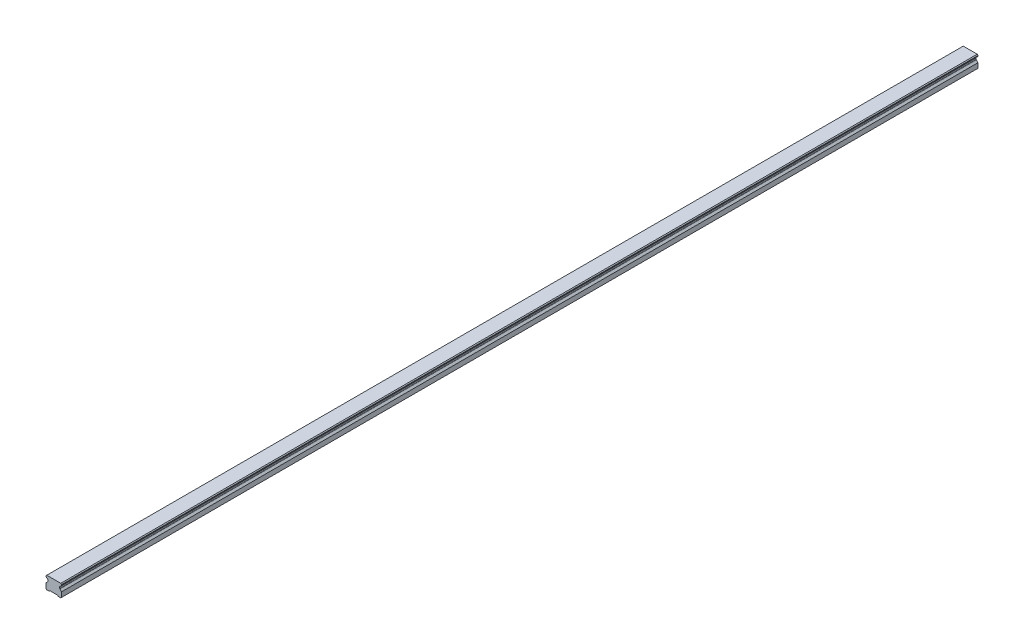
from build123d import *

# Parameters (mm, degrees)
SKETCH1_W           = 20
SKETCH1_H           = 16.3
BOSS_EXTRUDE1_DEPTH = 590
CUT_EXTRUDE1_DEPTH  = 1181.154943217
CHAMFER1_SIZE       = 1
FILLET1_R           = 1
CUT_EXTRUDE2_DEPTH  = 1181.154943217
SKETCH5_R           = 3
SKETCH5_R_2         = 2.5
CUT_EXTRUDE5_DEPTH  = 10
SKETCH5_2_R         = 2.5
CUT_EXTRUDE6_DEPTH  = 13
LPATTERN2_COUNT     = 20
LPATTERN2_PITCH     = 60


with BuildPart() as part:
    # Sketch1 → Boss-Extrude1 (new, symmetric)
    with BuildSketch(Plane.XY):
        with Locations((0, 8.15)):
            Rectangle(SKETCH1_W, SKETCH1_H)
    extrude(amount=BOSS_EXTRUDE1_DEPTH, both=True)

    # Sketch2 → Cut-Extrude1 (cut, through all)
    with BuildSketch(Plane.XY.offset(590)):
        Polygon((-10, 14.3), (-10, 7.3), (-7.666666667, 9.633333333), (-7.666666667, 11.966666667), align=None)
        Polygon((7.666666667, 11.966666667), (10, 14.3), (10, 7.3), (7.666666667, 9.633333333), align=None)
    extrude(amount=-CUT_EXTRUDE1_DEPTH, mode=Mode.SUBTRACT)

    # Chamfer1
    chamfer1_edges = [part.edges().sort_by_distance(p)[0] for p in [
        (-10, 16.3, 0),
        (10, 16.3, 0),
        (10, 0, 0),
        (-10, 0, 0),
    ]]
    chamfer(chamfer1_edges, length=CHAMFER1_SIZE)

    # Fillet1
    fillet1_edges = [part.edges().sort_by_distance(p)[0] for p in [
        (-7.666666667, 11.966666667, 0),
        (-7.666666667, 9.633333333, 0),
        (7.666666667, 9.633333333, 0),
        (7.666666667, 11.966666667, 0),
    ]]
    fillet(fillet1_edges, radius=FILLET1_R)

    # Sketch3 → Cut-Extrude2 (cut, through all)
    with BuildSketch(Plane.XY.offset(590)):
        Polygon((-6, 0), (-5, 1), (5, 1), (6, 0), align=None)
    extrude(amount=-CUT_EXTRUDE2_DEPTH, mode=Mode.SUBTRACT)

    # Sketch5 → Cut-Extrude5 (cut)
    with BuildSketch(Plane.XZ.offset(-1)):
        with Locations(Location((0, 570, 0), (0, 0, 270))):
            Circle(SKETCH5_R)
        with Locations(Location((0, 570, 0), (0, 0, 270))):
            Circle(SKETCH5_R_2, mode=Mode.SUBTRACT)
    cut_extrude5 = extrude(amount=-CUT_EXTRUDE5_DEPTH, mode=Mode.SUBTRACT)

    # Sketch5_2 → Cut-Extrude6 (cut)
    with BuildSketch(Plane.XZ.offset(-1)):
        with Locations(Location((0, 570, 0), (0, 0, 270))):
            Circle(SKETCH5_2_R)
    cut_extrude6 = extrude(amount=-CUT_EXTRUDE6_DEPTH, mode=Mode.SUBTRACT)

    # Cut-Extrude7 cone 1 section (on through the dimple's axis) → Cut-Extrude7 (revolve, cut)
    with BuildSketch(Plane(origin=(0, 14, 570), x_dir=(0, 0, -1), z_dir=(1, 0, 0))):
        Polygon((0, 0), (2.5, 0), (0, 1.443375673), align=None)
    cut_extrude7 = revolve(axis=Axis((0, 14, 570), (0, 1, 0)), mode=Mode.SUBTRACT)

    # LPattern2: Cut-Extrude5, Cut-Extrude6, Cut-Extrude7 ×20
    with Locations(*[(0, 0, -i * LPATTERN2_PITCH) for i in range(1, LPATTERN2_COUNT)]):
        add(cut_extrude5, mode=Mode.SUBTRACT)
        add(cut_extrude6, mode=Mode.SUBTRACT)
        add(cut_extrude7, mode=Mode.SUBTRACT)


solid = part.part
